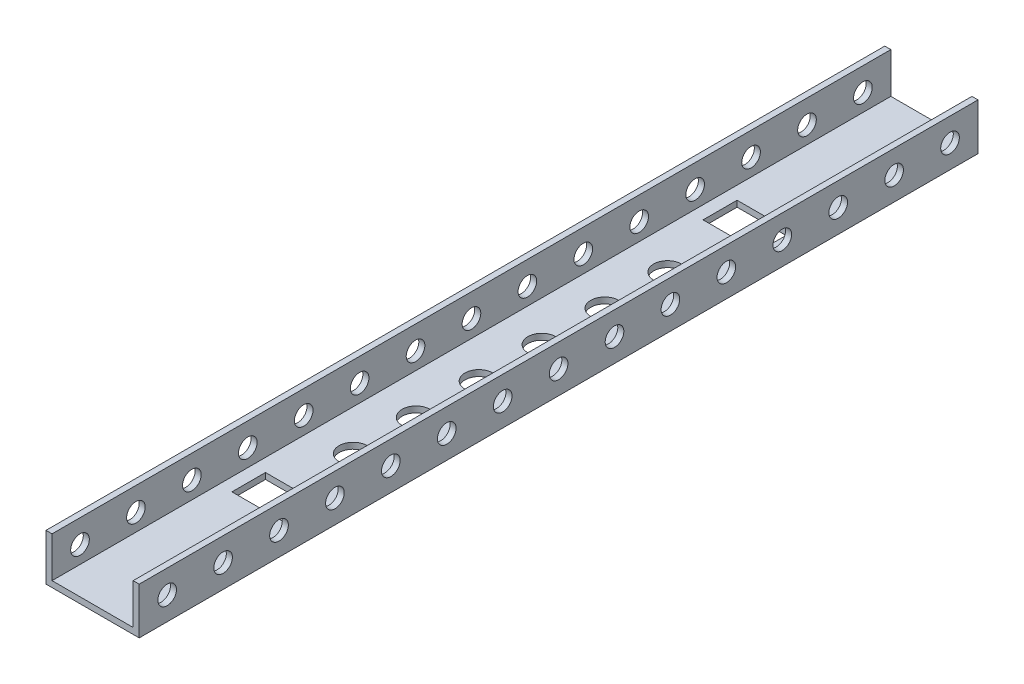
from build123d import *

# Parameters (mm, degrees)
BOSS_EXTRUDE1_DEPTH = 457.2
SKETCH3_R           = 5.08
CUT_EXTRUDE1_DEPTH  = 88.9
SKETCH4_R           = 5.08
CUT_EXTRUDE2_DEPTH  = 88.9
SKETCH5_W           = 29.972
SKETCH5_H           = 18.542
CUT_EXTRUDE3_DEPTH  = 88.9
SKETCH6_W           = 29.972
SKETCH6_H           = 18.288
CUT_EXTRUDE4_DEPTH  = 243.332
SKETCH7_R           = 7.62
CUT_EXTRUDE5_DEPTH  = 152.4


with BuildPart() as part:
    # Sketch2 → Boss-Extrude1 (new body)
    with BuildSketch(Plane.XY):
        Polygon((27.86918239, -18.110691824), (27.86918239, 7.289308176), (24.56718239, 7.289308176), (24.56718239, -14.808691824), (-19.62881761, -14.808691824), (-19.62881761, 7.289308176), (-22.93081761, 7.289308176), (-22.93081761, -18.110691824), align=None)
    extrude(amount=BOSS_EXTRUDE1_DEPTH)

    # Sketch3 → Cut-Extrude1 (cut)
    with BuildSketch(Plane(origin=(27.86918239, 0, 0), x_dir=(0, 0, -1), z_dir=(1, 0, 0))):
        with Locations((-228.6, -5.410691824)):
            Circle(SKETCH3_R)
    extrude(amount=-CUT_EXTRUDE1_DEPTH, mode=Mode.SUBTRACT)

    # Sketch4 → Cut-Extrude2 (cut)
    with BuildSketch(Plane(origin=(27.86918239, 0, 0), x_dir=(0, 0, -1), z_dir=(1, 0, 0))):
        with Locations((-259.08, -5.410691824)):
            Circle(SKETCH4_R)
        with Locations((-289.56, -5.410691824)):
            Circle(SKETCH4_R)
        with Locations((-320.04, -5.410691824)):
            Circle(SKETCH4_R)
        with Locations((-350.52, -5.410691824)):
            Circle(SKETCH4_R)
        with Locations((-381, -5.410691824)):
            Circle(SKETCH4_R)
        with Locations((-411.48, -5.410691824)):
            Circle(SKETCH4_R)
        with Locations((-198.12, -5.410691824)):
            Circle(SKETCH4_R)
        with Locations((-167.64, -5.410691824)):
            Circle(SKETCH4_R)
        with Locations((-137.16, -5.410691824)):
            Circle(SKETCH4_R)
        with Locations((-106.68, -5.410691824)):
            Circle(SKETCH4_R)
        with Locations((-76.2, -5.410691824)):
            Circle(SKETCH4_R)
        with Locations((-45.72, -5.410691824)):
            Circle(SKETCH4_R)
        with Locations((-441.96, -5.410691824)):
            Circle(SKETCH4_R)
        with Locations((-15.24, -5.410691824)):
            Circle(SKETCH4_R)
    extrude(amount=-CUT_EXTRUDE2_DEPTH, mode=Mode.SUBTRACT)

    # Sketch5 → Cut-Extrude3 (cut)
    with BuildSketch(Plane(origin=(0, -14.808691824, 0), x_dir=(1, 0, 0), z_dir=(0, 1, 0))):
        with Locations((2.46918239, -100.203)):
            Rectangle(SKETCH5_W, SKETCH5_H)
    extrude(amount=-CUT_EXTRUDE3_DEPTH, mode=Mode.SUBTRACT)

    # Sketch6 → Cut-Extrude4 (cut)
    with BuildSketch(Plane(origin=(0, -14.808691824, 0), x_dir=(1, 0, 0), z_dir=(0, 1, 0))):
        with Locations((2.46918239, -357.124)):
            Rectangle(SKETCH6_W, SKETCH6_H)
    extrude(amount=-CUT_EXTRUDE4_DEPTH, mode=Mode.SUBTRACT)

    # Sketch7 → Cut-Extrude5 (cut)
    with BuildSketch(Plane(origin=(0, -14.808691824, 0), x_dir=(1, 0, 0), z_dir=(0, 1, 0))):
        with Locations(Location((2.46918239, -143.764, 0), (0, 0, 180))):
            Circle(SKETCH7_R)
        with Locations(Location((2.46918239, -178.054, 0), (0, 0, 180))):
            Circle(SKETCH7_R)
        with Locations(Location((2.46918239, -212.344, 0), (0, 0, 180))):
            Circle(SKETCH7_R)
        with Locations(Location((2.46918239, -246.634, 0), (0, 0, 180))):
            Circle(SKETCH7_R)
        with Locations(Location((2.46918239, -280.924, 0), (0, 0, 180))):
            Circle(SKETCH7_R)
        with Locations(Location((2.46918239, -315.214, 0), (0, 0, 180))):
            Circle(SKETCH7_R)
    extrude(amount=-CUT_EXTRUDE5_DEPTH, mode=Mode.SUBTRACT)


solid = part.part
